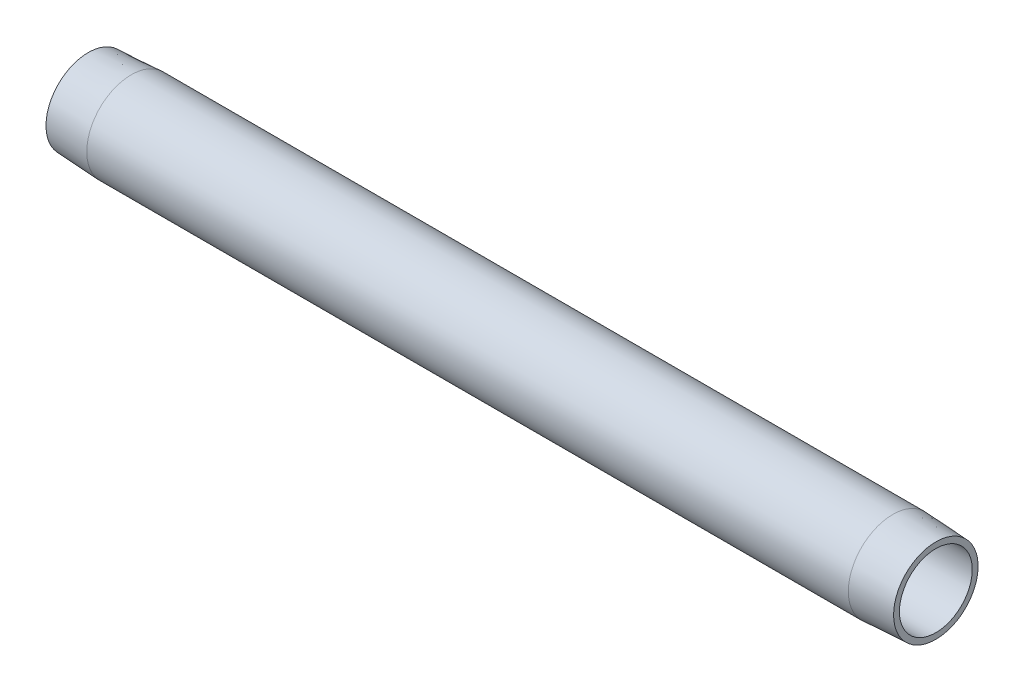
from build123d import *


with BuildPart() as part:
    # Sketch1 → Revolve1 (revolve)
    with BuildSketch(Plane.XY, mode=Mode.PRIVATE) as revolve1_sk:
        Polygon((203.2, 8.73125), (0, 8.73125), (0, 10.127550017), (10.3124, 10.668), (192.8876, 10.668), (203.2, 10.127550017), align=None)
    revolve(revolve1_sk.sketch.rotate(Axis((0, 0, 0), (1, 0, 0)), 90), axis=Axis((0, 0, 0), (1, 0, 0)))


solid = part.part
